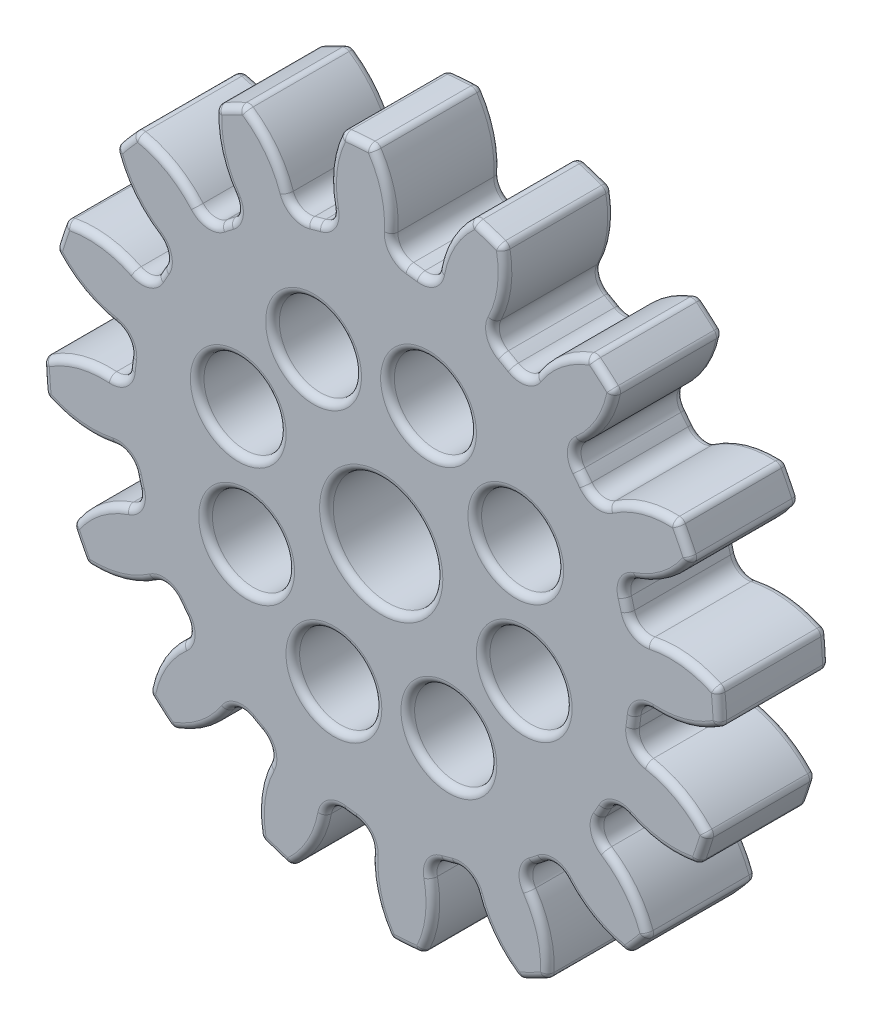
from build123d import *

# Parameters (mm, degrees)
EXTRUDE_1_DEPTH          = 4
PATTERN_CIRCULAR_1_COUNT = 16
SKETCH_2_R               = 18.5625
SKETCH_2_R_2             = 4
EXTRUDE_2_DEPTH          = 4
EXTRUDE_3_DEPTH          = 4
PATTERN_CIRCULAR_2_COUNT = 16
CUT_EXTRUDE_1_DEPTH      = 4
PATTERN_CIRCULAR_3_COUNT = 16
SKETCH_5_R               = 3
CUT_EXTRUDE_2_DEPTH      = 4
FILLET_1_R               = 0.5


with BuildPart() as part:
    # Sketch 1 → Extrude 1 (new, symmetric)
    with BuildSketch(Plane.XY):
        with BuildLine():
            ThreePointArc((-0.671963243, 24.740876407), (-1.805963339, 24.6840231), (-2.936162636, 24.575220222))
            ThreePointArc((-2.936162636, 24.575220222), (-3.765035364, 21.459091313), (-3.231357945, 18.279079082))
            ThreePointArc((-3.231357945, 18.279079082), (-1.354472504, 18.513017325), (0.536475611, 18.554746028))
            ThreePointArc((0.536475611, 18.554746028), (0.601627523, 21.778570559), (-0.671963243, 24.740876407))
        make_face()
    extrude(amount=EXTRUDE_1_DEPTH, both=True)


with BuildPart() as pattern_circular_1_1:
    # Pattern Circular 1: pattern copy
    add(part.part.rotate(Axis((0, 0, 0), (0, 0, 1)), 1 * 360 / PATTERN_CIRCULAR_1_COUNT))


with BuildPart() as pattern_circular_1_2:
    # Pattern Circular 1: pattern copy
    add(part.part.rotate(Axis((0, 0, 0), (0, 0, 1)), 2 * 360 / PATTERN_CIRCULAR_1_COUNT))


with BuildPart() as pattern_circular_1_3:
    # Pattern Circular 1: pattern copy
    add(part.part.rotate(Axis((0, 0, 0), (0, 0, 1)), 3 * 360 / PATTERN_CIRCULAR_1_COUNT))


with BuildPart() as pattern_circular_1_4:
    # Pattern Circular 1: pattern copy
    add(part.part.rotate(Axis((0, 0, 0), (0, 0, 1)), 4 * 360 / PATTERN_CIRCULAR_1_COUNT))


with BuildPart() as pattern_circular_1_5:
    # Pattern Circular 1: pattern copy
    add(part.part.rotate(Axis((0, 0, 0), (0, 0, 1)), 5 * 360 / PATTERN_CIRCULAR_1_COUNT))


with BuildPart() as pattern_circular_1_6:
    # Pattern Circular 1: pattern copy
    add(part.part.rotate(Axis((0, 0, 0), (0, 0, 1)), 6 * 360 / PATTERN_CIRCULAR_1_COUNT))


with BuildPart() as pattern_circular_1_7:
    # Pattern Circular 1: pattern copy
    add(part.part.rotate(Axis((0, 0, 0), (0, 0, 1)), 7 * 360 / PATTERN_CIRCULAR_1_COUNT))


with BuildPart() as pattern_circular_1_8:
    # Pattern Circular 1: pattern copy
    add(part.part.rotate(Axis((0, 0, 0), (0, 0, 1)), 8 * 360 / PATTERN_CIRCULAR_1_COUNT))


with BuildPart() as pattern_circular_1_9:
    # Pattern Circular 1: pattern copy
    add(part.part.rotate(Axis((0, 0, 0), (0, 0, 1)), 9 * 360 / PATTERN_CIRCULAR_1_COUNT))


with BuildPart() as pattern_circular_1_10:
    # Pattern Circular 1: pattern copy
    add(part.part.rotate(Axis((0, 0, 0), (0, 0, 1)), 10 * 360 / PATTERN_CIRCULAR_1_COUNT))


with BuildPart() as pattern_circular_1_11:
    # Pattern Circular 1: pattern copy
    add(part.part.rotate(Axis((0, 0, 0), (0, 0, 1)), 11 * 360 / PATTERN_CIRCULAR_1_COUNT))


with BuildPart() as pattern_circular_1_12:
    # Pattern Circular 1: pattern copy
    add(part.part.rotate(Axis((0, 0, 0), (0, 0, 1)), 12 * 360 / PATTERN_CIRCULAR_1_COUNT))


with BuildPart() as pattern_circular_1_13:
    # Pattern Circular 1: pattern copy
    add(part.part.rotate(Axis((0, 0, 0), (0, 0, 1)), 13 * 360 / PATTERN_CIRCULAR_1_COUNT))


with BuildPart() as pattern_circular_1_14:
    # Pattern Circular 1: pattern copy
    add(part.part.rotate(Axis((0, 0, 0), (0, 0, 1)), 14 * 360 / PATTERN_CIRCULAR_1_COUNT))


with BuildPart() as pattern_circular_1_15:
    # Pattern Circular 1: pattern copy
    add(part.part.rotate(Axis((0, 0, 0), (0, 0, 1)), 15 * 360 / PATTERN_CIRCULAR_1_COUNT))


with BuildPart() as part_1:
    add(part.part)

    add(pattern_circular_1_1.part)  # Extrude 2 merges Pattern Circular 1_1

    add(pattern_circular_1_2.part)  # Extrude 2 merges Pattern Circular 1_2

    add(pattern_circular_1_3.part)  # Extrude 2 merges Pattern Circular 1_3

    add(pattern_circular_1_4.part)  # Extrude 2 merges Pattern Circular 1_4

    add(pattern_circular_1_5.part)  # Extrude 2 merges Pattern Circular 1_5

    add(pattern_circular_1_6.part)  # Extrude 2 merges Pattern Circular 1_6

    add(pattern_circular_1_7.part)  # Extrude 2 merges Pattern Circular 1_7

    add(pattern_circular_1_8.part)  # Extrude 2 merges Pattern Circular 1_8

    add(pattern_circular_1_9.part)  # Extrude 2 merges Pattern Circular 1_9

    add(pattern_circular_1_10.part)  # Extrude 2 merges Pattern Circular 1_10

    add(pattern_circular_1_11.part)  # Extrude 2 merges Pattern Circular 1_11

    add(pattern_circular_1_12.part)  # Extrude 2 merges Pattern Circular 1_12

    add(pattern_circular_1_13.part)  # Extrude 2 merges Pattern Circular 1_13

    add(pattern_circular_1_14.part)  # Extrude 2 merges Pattern Circular 1_14

    add(pattern_circular_1_15.part)  # Extrude 2 merges Pattern Circular 1_15
    # Sketch 2 → Extrude 2 (add, symmetric)
    with BuildSketch(Plane.XY):
        Circle(SKETCH_2_R)
        Circle(SKETCH_2_R_2, mode=Mode.SUBTRACT)
    extrude(amount=EXTRUDE_2_DEPTH, both=True)

    # Sketch 3 → Extrude 3 (add, symmetric)
    with BuildSketch(Plane.XY):
        with BuildLine():
            ThreePointArc((0.536475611, 18.554746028), (0.657903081, 19.181192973), (0.726508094, 19.815601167))
            ThreePointArc((0.726508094, 19.815601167), (1.024144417, 18.911813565), (1.8660827, 18.468463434))
            ThreePointArc((1.8660827, 18.468463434), (1.202053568, 18.523538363), (0.536475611, 18.554746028))
        make_face()
        with BuildLine():
            ThreePointArc((4.009715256, 18.124254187), (3.356658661, 18.256485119), (2.699277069, 18.365192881))
            ThreePointArc((2.699277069, 18.365192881), (3.623977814, 18.589576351), (4.133258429, 19.393350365))
            ThreePointArc((4.133258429, 19.393350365), (4.044902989, 18.761390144), (4.009715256, 18.124254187))
        make_face()
    extrude_3 = extrude(amount=EXTRUDE_3_DEPTH, both=True)

    # Pattern Circular 2: Extrude 3 ×16 about axis
    pattern_circular_2_axis = Axis((0, 0, 0), (0, 0, 1))
    for i in range(1, PATTERN_CIRCULAR_2_COUNT):
        add(extrude_3.rotate(pattern_circular_2_axis, i * 360 / PATTERN_CIRCULAR_2_COUNT))

    # Sketch 4 → Cut-Extrude 1 (cut, symmetric)
    with BuildSketch(Plane.XY):
        with BuildLine():
            ThreePointArc((-0.671963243, 24.740876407), (-0.810309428, 24.736731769), (-0.948630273, 24.731813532))
            ThreePointArc((-0.948630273, 24.731813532), (-0.700689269, 24.676771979), (-0.511776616, 24.507018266))
            ThreePointArc((-0.511776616, 24.507018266), (-0.590782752, 24.624692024), (-0.671963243, 24.740876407))
        make_face()
        with BuildLine():
            ThreePointArc((-2.936162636, 24.575220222), (-2.999568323, 24.448457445), (-3.060606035, 24.320537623))
            ThreePointArc((-3.060606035, 24.320537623), (-2.898412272, 24.515979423), (-2.661122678, 24.606522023))
            ThreePointArc((-2.661122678, 24.606522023), (-2.798686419, 24.591255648), (-2.936162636, 24.575220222))
        make_face()
    cut_extrude_1 = extrude(amount=CUT_EXTRUDE_1_DEPTH, both=True, mode=Mode.SUBTRACT)

    # Pattern Circular 3: Cut-Extrude 1 ×16 about axis
    pattern_circular_3_axis = Axis((0, 0, 0), (0, 0, 1))
    for i in range(1, PATTERN_CIRCULAR_3_COUNT):
        add(cut_extrude_1.rotate(pattern_circular_3_axis, i * 360 / PATTERN_CIRCULAR_3_COUNT), mode=Mode.SUBTRACT)

    # Sketch 5 → Cut-Extrude 2 (cut, symmetric)
    with BuildSketch(Plane.XY):
        with Locations((3.456744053, 10.442744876)):
            Circle(SKETCH_5_R)
        with Locations((9.828422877, 4.939848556)):
            Circle(SKETCH_5_R)
        with Locations((10.442744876, -3.456744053)):
            Circle(SKETCH_5_R)
        with Locations((4.939848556, -9.828422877)):
            Circle(SKETCH_5_R)
        with Locations((-3.456744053, -10.442744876)):
            Circle(SKETCH_5_R)
        with Locations((-9.828422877, -4.939848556)):
            Circle(SKETCH_5_R)
        with Locations((-10.442744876, 3.456744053)):
            Circle(SKETCH_5_R)
        with Locations((-4.939848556, 9.828422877)):
            Circle(SKETCH_5_R)
    extrude(amount=CUT_EXTRUDE_2_DEPTH, both=True, mode=Mode.SUBTRACT)

    # Fillet 1
    fillet_1_edges = [part_1.edges().sort_by_distance(p)[0] for p in [
        (-6.456744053, -10.442744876, -4),
        (-6.456744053, -10.442744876, 4),
        (-12.828422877, -4.939848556, -4),
        (-12.828422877, -4.939848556, 4),
        (-13.442744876, 3.456744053, -4),
        (-13.442744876, 3.456744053, 4),
        (-7.939848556, 9.828422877, -4),
        (-7.939848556, 9.828422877, 4),
        (-4, 0, -4),
        (-4, 0, 4),
        (0.490625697, 22.26246997, -4),
        (0.490625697, 22.26246997, 4),
        (1.024144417, 18.911813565, -4),
        (1.024144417, 18.911813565, 4),
        (2.283263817, 18.421539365, -4),
        (2.283263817, 18.421539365, 4),
        (3.623977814, 18.589576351, -4),
        (3.623977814, 18.589576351, 4),
        (8.97275746, 20.380086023, -4),
        (8.97275746, 20.380086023, 4),
        (8.183423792, 17.080314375, -4),
        (8.183423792, 17.080314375, 4),
        (9.159078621, 16.145515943, -4),
        (9.159078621, 16.145515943, 4),
        (10.462041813, 15.78769284, -4),
        (10.462041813, 15.78769284, 4),
        (16.088868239, 15.395018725, -4),
        (16.088868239, 15.395018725, 4),
        (14.096851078, 12.648492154, -4),
        (14.096851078, 12.648492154, 4),
        (14.640506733, 11.411484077, -4),
        (14.640506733, 11.411484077, 4),
        (15.707354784, 10.58227621, -4),
        (15.707354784, 10.58227621, 4),
        (20.755594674, 8.066199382, -4),
        (20.755594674, 8.066199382, 4),
        (17.864160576, 6.291051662, -4),
        (17.864160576, 6.291051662, 4),
        (17.893050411, 4.940157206, -4),
        (17.893050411, 4.940157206, 4),
        (18.561365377, 3.765803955, -4),
        (18.561365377, 3.765803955, 4),
        (22.26246997, -0.490625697, -4),
        (22.26246997, -0.490625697, 4),
        (18.911813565, -1.024144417, -4),
        (18.911813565, -1.024144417, 4),
        (18.421539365, -2.283263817, -4),
        (18.421539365, -2.283263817, 4),
        (18.589576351, -3.623977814, -4),
        (18.589576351, -3.623977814, 4),
        (20.380086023, -8.97275746, -4),
        (20.380086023, -8.97275746, 4),
        (17.080314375, -8.183423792, -4),
        (17.080314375, -8.183423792, 4),
        (16.145515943, -9.159078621, -4),
        (16.145515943, -9.159078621, 4),
        (15.78769284, -10.462041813, -4),
        (15.78769284, -10.462041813, 4),
        (15.395018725, -16.088868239, -4),
        (15.395018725, -16.088868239, 4),
        (12.648492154, -14.096851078, -4),
        (12.648492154, -14.096851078, 4),
        (11.411484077, -14.640506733, -4),
        (11.411484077, -14.640506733, 4),
        (10.58227621, -15.707354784, -4),
        (10.58227621, -15.707354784, 4),
        (8.066199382, -20.755594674, -4),
        (8.066199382, -20.755594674, 4),
        (6.291051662, -17.864160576, -4),
        (6.291051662, -17.864160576, 4),
        (4.940157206, -17.893050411, -4),
        (4.940157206, -17.893050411, 4),
        (3.765803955, -18.561365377, -4),
        (3.765803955, -18.561365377, 4),
        (-0.490625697, -22.26246997, -4),
        (-0.490625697, -22.26246997, 4),
        (-1.024144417, -18.911813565, -4),
        (-1.024144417, -18.911813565, 4),
        (-2.283263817, -18.421539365, -4),
        (-2.283263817, -18.421539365, 4),
        (-3.623977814, -18.589576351, -4),
        (-3.623977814, -18.589576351, 4),
        (-8.97275746, -20.380086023, -4),
        (-8.97275746, -20.380086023, 4),
        (-8.183423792, -17.080314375, -4),
        (-8.183423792, -17.080314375, 4),
        (-9.159078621, -16.145515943, -4),
        (-9.159078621, -16.145515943, 4),
        (-10.462041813, -15.78769284, -4),
        (-10.462041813, -15.78769284, 4),
        (-16.088868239, -15.395018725, -4),
        (-16.088868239, -15.395018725, 4),
        (-14.096851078, -12.648492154, -4),
        (-14.096851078, -12.648492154, 4),
        (-14.640506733, -11.411484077, -4),
        (-14.640506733, -11.411484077, 4),
        (-15.707354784, -10.58227621, -4),
        (-15.707354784, -10.58227621, 4),
        (-20.755594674, -8.066199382, -4),
        (-20.755594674, -8.066199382, 4),
        (-17.864160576, -6.291051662, -4),
        (-17.864160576, -6.291051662, 4),
        (-17.893050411, -4.940157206, -4),
        (-17.893050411, -4.940157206, 4),
        (-18.561365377, -3.765803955, -4),
        (-18.561365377, -3.765803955, 4),
        (-22.26246997, 0.490625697, -4),
        (-22.26246997, 0.490625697, 4),
        (-18.911813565, 1.024144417, -4),
        (-18.911813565, 1.024144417, 4),
        (-18.421539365, 2.283263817, -4),
        (-18.421539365, 2.283263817, 4),
        (-18.589576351, 3.623977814, -4),
        (-18.589576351, 3.623977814, 4),
        (-20.380086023, 8.97275746, -4),
        (-20.380086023, 8.97275746, 4),
        (-17.080314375, 8.183423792, -4),
        (-17.080314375, 8.183423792, 4),
        (-16.145515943, 9.159078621, -4),
        (-16.145515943, 9.159078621, 4),
        (-15.78769284, 10.462041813, -4),
        (-15.78769284, 10.462041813, 4),
        (-15.395018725, 16.088868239, -4),
        (-15.395018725, 16.088868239, 4),
        (-12.648492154, 14.096851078, -4),
        (-12.648492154, 14.096851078, 4),
        (-11.411484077, 14.640506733, -4),
        (-11.411484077, 14.640506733, 4),
        (-10.58227621, 15.707354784, -4),
        (-10.58227621, 15.707354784, 4),
        (-8.066199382, 20.755594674, -4),
        (-8.066199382, 20.755594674, 4),
        (-6.291051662, 17.864160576, -4),
        (-6.291051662, 17.864160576, 4),
        (-4.940157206, 17.893050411, -4),
        (-4.940157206, 17.893050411, 4),
        (-3.765803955, 18.561365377, -4),
        (-3.765803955, 18.561365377, 4),
        (-1.805963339, 24.6840231, -4),
        (-1.805963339, 24.6840231, 4),
        (-0.700689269, 24.676771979, -4),
        (-0.700689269, 24.676771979, 4),
        (-3.725645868, 21.953993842, -4),
        (-3.725645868, 21.953993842, 4),
        (-2.898412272, 24.515979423, -4),
        (-2.898412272, 24.515979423, 4),
        (7.777674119, 23.496175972, -4),
        (7.777674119, 23.496175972, 4),
        (8.796039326, 23.066506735, -4),
        (8.796039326, 23.066506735, 4),
        (4.959381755, 21.708588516, -4),
        (4.959381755, 21.708588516, 4),
        (6.704075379, 23.758985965, -4),
        (6.704075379, 23.758985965, 4),
        (16.177231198, 18.731249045, -4),
        (16.177231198, 18.731249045, 4),
        (16.953650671, 17.944574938, -4),
        (16.953650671, 17.944574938, 4),
        (12.889388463, 18.158247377, -4),
        (12.889388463, 18.158247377, 4),
        (15.285928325, 19.38490227, -4),
        (15.285928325, 19.38490227, 4),
        (22.113951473, 11.11465925, -4),
        (22.113951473, 11.11465925, 4),
        (22.530222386, 10.090744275, -4),
        (22.530222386, 10.090744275, 4),
        (18.857102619, 11.84347768, -4),
        (18.857102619, 11.84347768, 4),
        (21.540637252, 12.059642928, -4),
        (21.540637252, 12.059642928, 4),
        (24.6840231, 1.805963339, -4),
        (24.6840231, 1.805963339, 4),
        (24.676771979, 0.700689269, -4),
        (24.676771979, 0.700689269, 4),
        (21.953993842, 3.725645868, -4),
        (21.953993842, 3.725645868, 4),
        (24.515979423, 2.898412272, -4),
        (24.515979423, 2.898412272, 4),
        (23.496175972, -7.777674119, -4),
        (23.496175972, -7.777674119, 4),
        (23.066506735, -8.796039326, -4),
        (23.066506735, -8.796039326, 4),
        (21.708588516, -4.959381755, -4),
        (21.708588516, -4.959381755, 4),
        (23.758985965, -6.704075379, -4),
        (23.758985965, -6.704075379, 4),
        (18.731249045, -16.177231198, -4),
        (18.731249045, -16.177231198, 4),
        (17.944574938, -16.953650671, -4),
        (17.944574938, -16.953650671, 4),
        (18.158247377, -12.889388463, -4),
        (18.158247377, -12.889388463, 4),
        (19.38490227, -15.285928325, -4),
        (19.38490227, -15.285928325, 4),
        (11.11465925, -22.113951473, -4),
        (11.11465925, -22.113951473, 4),
        (10.090744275, -22.530222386, -4),
        (10.090744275, -22.530222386, 4),
        (11.84347768, -18.857102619, -4),
        (11.84347768, -18.857102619, 4),
        (12.059642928, -21.540637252, -4),
        (12.059642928, -21.540637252, 4),
        (1.805963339, -24.6840231, -4),
        (1.805963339, -24.6840231, 4),
        (0.700689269, -24.676771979, -4),
        (0.700689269, -24.676771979, 4),
        (3.725645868, -21.953993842, -4),
        (3.725645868, -21.953993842, 4),
        (2.898412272, -24.515979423, -4),
        (2.898412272, -24.515979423, 4),
        (-7.777674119, -23.496175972, -4),
        (-7.777674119, -23.496175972, 4),
        (-8.796039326, -23.066506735, -4),
        (-8.796039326, -23.066506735, 4),
        (-4.959381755, -21.708588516, -4),
        (-4.959381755, -21.708588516, 4),
        (-6.704075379, -23.758985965, -4),
        (-6.704075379, -23.758985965, 4),
        (-16.177231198, -18.731249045, -4),
        (-16.177231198, -18.731249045, 4),
        (-16.953650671, -17.944574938, -4),
        (-16.953650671, -17.944574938, 4),
        (-12.889388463, -18.158247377, -4),
        (-12.889388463, -18.158247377, 4),
        (-15.285928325, -19.38490227, -4),
        (-15.285928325, -19.38490227, 4),
        (-22.113951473, -11.11465925, -4),
        (-22.113951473, -11.11465925, 4),
        (-22.530222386, -10.090744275, -4),
        (-22.530222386, -10.090744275, 4),
        (-18.857102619, -11.84347768, -4),
        (-18.857102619, -11.84347768, 4),
        (-21.540637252, -12.059642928, -4),
        (-21.540637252, -12.059642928, 4),
        (-24.6840231, -1.805963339, -4),
        (-24.6840231, -1.805963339, 4),
        (-24.676771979, -0.700689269, -4),
        (-24.676771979, -0.700689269, 4),
        (-21.953993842, -3.725645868, -4),
        (-21.953993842, -3.725645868, 4),
        (-24.515979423, -2.898412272, -4),
        (-24.515979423, -2.898412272, 4),
        (-23.496175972, 7.777674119, -4),
        (-23.496175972, 7.777674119, 4),
        (-23.066506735, 8.796039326, -4),
        (-23.066506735, 8.796039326, 4),
        (-21.708588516, 4.959381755, -4),
        (-21.708588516, 4.959381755, 4),
        (-23.758985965, 6.704075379, -4),
        (-23.758985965, 6.704075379, 4),
        (-18.731249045, 16.177231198, -4),
        (-18.731249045, 16.177231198, 4),
        (-17.944574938, 16.953650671, -4),
        (-17.944574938, 16.953650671, 4),
        (-18.158247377, 12.889388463, -4),
        (-18.158247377, 12.889388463, 4),
        (-19.38490227, 15.285928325, -4),
        (-19.38490227, 15.285928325, 4),
        (-11.11465925, 22.113951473, -4),
        (-11.11465925, 22.113951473, 4),
        (-10.090744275, 22.530222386, -4),
        (-10.090744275, 22.530222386, 4),
        (-11.84347768, 18.857102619, -4),
        (-11.84347768, 18.857102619, 4),
        (-12.059642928, 21.540637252, -4),
        (-12.059642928, 21.540637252, 4),
        (0.456744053, 10.442744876, -4),
        (0.456744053, 10.442744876, 4),
        (6.828422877, 4.939848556, -4),
        (6.828422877, 4.939848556, 4),
        (7.442744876, -3.456744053, -4),
        (7.442744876, -3.456744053, 4),
        (1.939848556, -9.828422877, -4),
        (1.939848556, -9.828422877, 4),
    ]]
    fillet(fillet_1_edges, radius=FILLET_1_R)


solid = part_1.part
